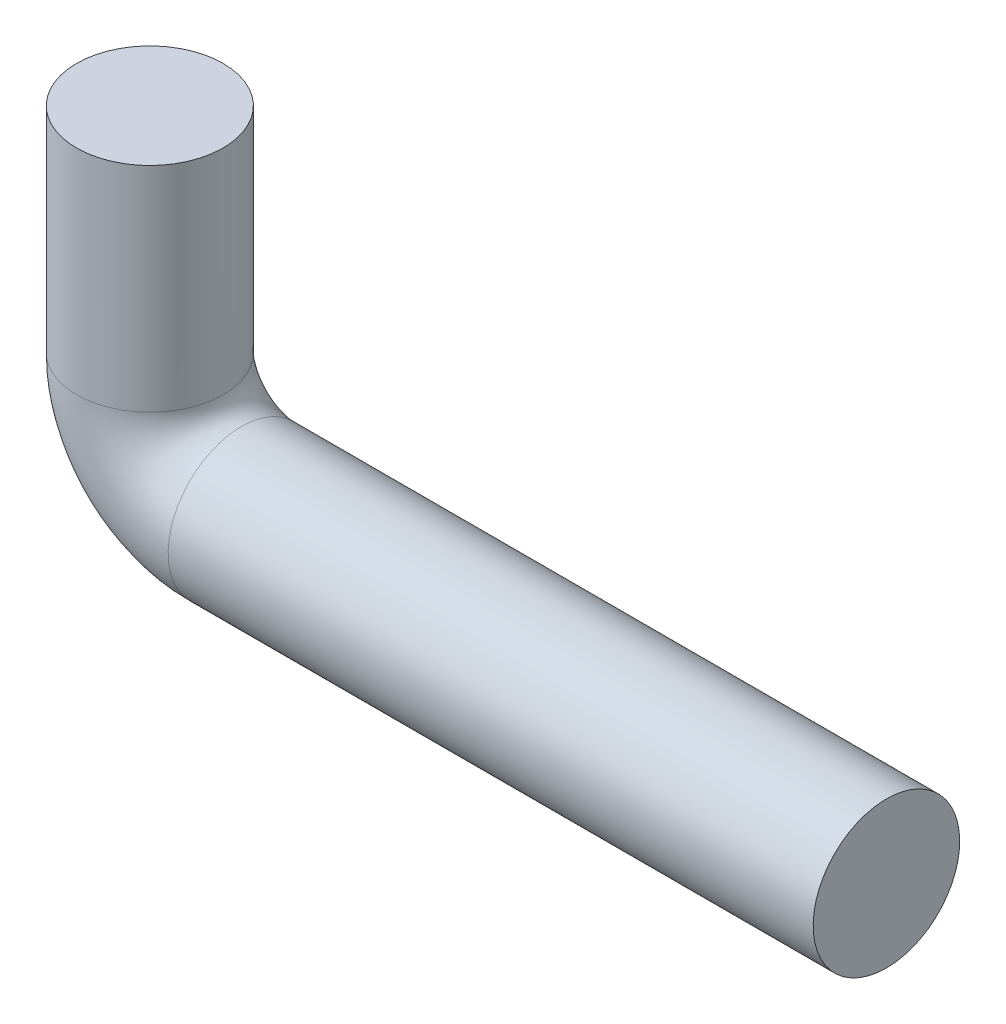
from build123d import *

# Parameters (mm, degrees)
FRONT_SHAFT_PROFILE_R = 12


with BuildPart() as part:
    # front shaft: sweep along a path in Sketch path front shaft
    with BuildLine(Plane.XY) as front_shaft_path:
        Line((120.65, 0), (15, 0))
        ThreePointArc((15, 0), (4.393398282, 4.393398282), (0, 15))
        Line((0, 15), (0, 50))
    # front shaft profile (on start of the path) → front shaft (sweep)
    with BuildSketch(Plane(origin=(120.65, 0, 0), x_dir=(0, 0, -1), z_dir=(-1, 0, 0))):
        Circle(FRONT_SHAFT_PROFILE_R)
    sweep(path=front_shaft_path.line)


solid = part.part
